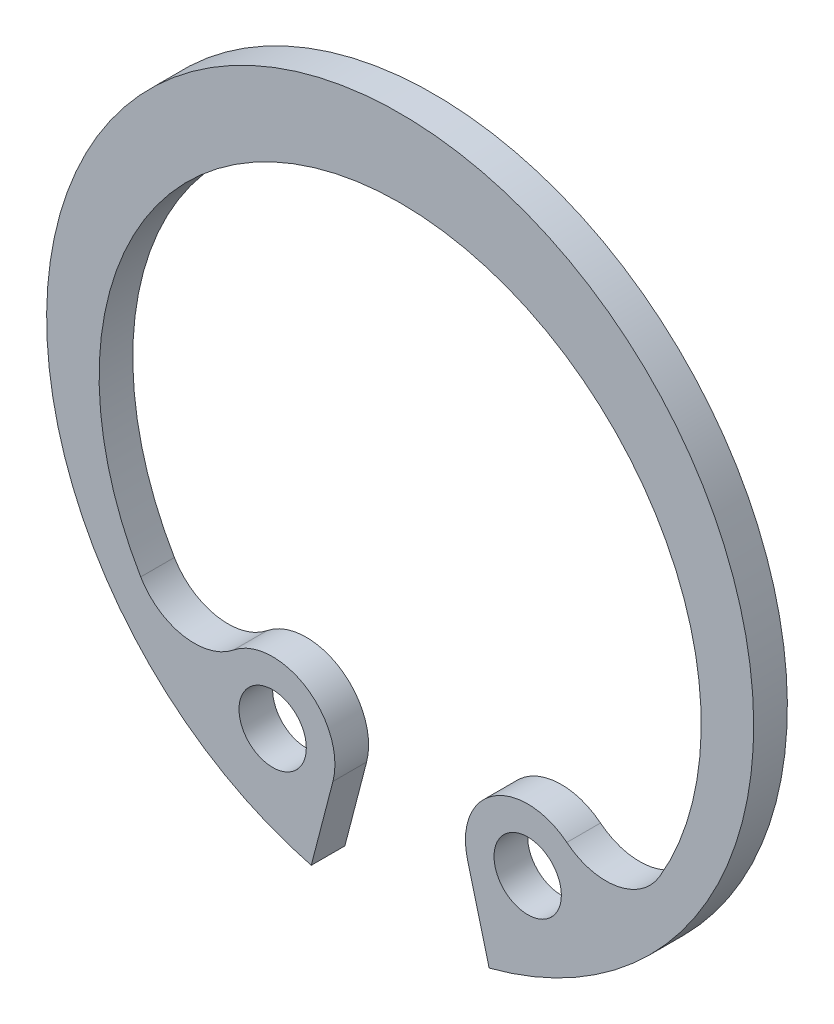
ISO-10303-21;
HEADER;
FILE_DESCRIPTION(('STEP AP214'),'2;1');
FILE_NAME('part.step','',(''),(''),'','','');
FILE_SCHEMA(('AUTOMOTIVE_DESIGN { 1 0 10303 214 1 1 1 1 }'));
ENDSEC;
DATA;
#1=APPLICATION_CONTEXT('core data for automotive mechanical design processes');
#2=APPLICATION_PROTOCOL_DEFINITION('international standard','automotive_design',2000,#1);
#3=PRODUCT_CONTEXT('',#1,'mechanical');
#4=PRODUCT('Part','Part','',(#3));
#5=PRODUCT_RELATED_PRODUCT_CATEGORY('part','',(#4));
#6=PRODUCT_DEFINITION_FORMATION('','',#4);
#7=PRODUCT_DEFINITION_CONTEXT('part definition',#1,'design');
#8=PRODUCT_DEFINITION('design','',#6,#7);
#9=PRODUCT_DEFINITION_SHAPE('','',#8);
#10=(LENGTH_UNIT() NAMED_UNIT(*) SI_UNIT(.MILLI.,.METRE.));
#11=(NAMED_UNIT(*) PLANE_ANGLE_UNIT() SI_UNIT($,.RADIAN.));
#12=(NAMED_UNIT(*) SI_UNIT($,.STERADIAN.) SOLID_ANGLE_UNIT());
#13=UNCERTAINTY_MEASURE_WITH_UNIT(LENGTH_MEASURE(1.E-05),#10,'distance_accuracy_value','');
#14=(GEOMETRIC_REPRESENTATION_CONTEXT(3) GLOBAL_UNCERTAINTY_ASSIGNED_CONTEXT((#13)) GLOBAL_UNIT_ASSIGNED_CONTEXT((#10,
#11,#12)) REPRESENTATION_CONTEXT('',''));
#15=CARTESIAN_POINT('',(0.,0.,0.));
#16=DIRECTION('',(0.,0.,1.));
#17=DIRECTION('',(1.,0.,0.));
#18=AXIS2_PLACEMENT_3D('',#15,#16,#17);
#19=CARTESIAN_POINT('',(0.,0.,-1.));
#20=DIRECTION('',(0.,0.,1.));
#21=DIRECTION('',(1.,0.,0.));
#22=AXIS2_PLACEMENT_3D('',#19,#20,#21);
#23=CYLINDRICAL_SURFACE('',#22,10.5);
#24=CARTESIAN_POINT('',(0.,0.,0.));
#25=DIRECTION('',(0.,0.,1.));
#26=DIRECTION('',(1.,0.,0.));
#27=AXIS2_PLACEMENT_3D('',#24,#25,#26);
#28=CIRCLE('',#27,10.5);
#29=CARTESIAN_POINT('',(2.64166101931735,-10.162264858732,0.));
#30=VERTEX_POINT('',#29);
#31=CARTESIAN_POINT('',(-2.64166101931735,-10.162264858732,0.));
#32=VERTEX_POINT('',#31);
#33=EDGE_CURVE('E130',#30,#32,#28,.T.);
#34=ORIENTED_EDGE('',*,*,#33,.F.);
#35=DIRECTION('',(0.,0.,1.));
#36=VECTOR('',#35,1.);
#37=CARTESIAN_POINT('',(2.64166101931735,-10.162264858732,-1.));
#38=LINE('',#37,#36);
#39=CARTESIAN_POINT('',(2.64166101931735,-10.162264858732,-1.));
#40=VERTEX_POINT('',#39);
#41=EDGE_CURVE('E11',#40,#30,#38,.T.);
#42=ORIENTED_EDGE('',*,*,#41,.F.);
#43=CARTESIAN_POINT('',(0.,0.,-1.));
#44=DIRECTION('',(0.,0.,1.));
#45=DIRECTION('',(1.,0.,0.));
#46=AXIS2_PLACEMENT_3D('',#43,#44,#45);
#47=CIRCLE('',#46,10.5);
#48=CARTESIAN_POINT('',(-2.64166101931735,-10.162264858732,-1.));
#49=VERTEX_POINT('',#48);
#50=EDGE_CURVE('E151',#40,#49,#47,.T.);
#51=ORIENTED_EDGE('',*,*,#50,.T.);
#52=DIRECTION('',(0.,0.,1.));
#53=VECTOR('',#52,1.);
#54=CARTESIAN_POINT('',(-2.64166101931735,-10.162264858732,-1.));
#55=LINE('',#54,#53);
#56=EDGE_CURVE('E36',#49,#32,#55,.T.);
#57=ORIENTED_EDGE('',*,*,#56,.T.);
#58=EDGE_LOOP('',(#34,#42,#51,#57));
#59=FACE_BOUND('',#58,.T.);
#60=ADVANCED_FACE('F33',(#59),#23,.T.);
#61=CARTESIAN_POINT('',(2.64166101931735,-10.162264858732,-1.));
#62=DIRECTION('',(-0.967834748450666,-0.251586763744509,0.));
#63=DIRECTION('',(0.251586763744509,-0.967834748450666,0.));
#64=AXIS2_PLACEMENT_3D('',#61,#62,#63);
#65=PLANE('',#64);
#66=DIRECTION('',(0.251586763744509,-0.967834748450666,0.));
#67=VECTOR('',#66,1.);
#68=CARTESIAN_POINT('',(2.64166101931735,-10.162264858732,0.));
#69=LINE('',#68,#67);
#70=CARTESIAN_POINT('',(1.9969080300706,-7.68195016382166,0.));
#71=VERTEX_POINT('',#70);
#72=EDGE_CURVE('E149',#71,#30,#69,.T.);
#73=ORIENTED_EDGE('',*,*,#72,.F.);
#74=DIRECTION('',(0.,0.,1.));
#75=VECTOR('',#74,1.);
#76=CARTESIAN_POINT('',(1.9969080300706,-7.68195016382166,-1.));
#77=LINE('',#76,#75);
#78=CARTESIAN_POINT('',(1.9969080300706,-7.68195016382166,-1.));
#79=VERTEX_POINT('',#78);
#80=EDGE_CURVE('E42',#79,#71,#77,.T.);
#81=ORIENTED_EDGE('',*,*,#80,.F.);
#82=DIRECTION('',(0.251586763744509,-0.967834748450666,0.));
#83=VECTOR('',#82,1.);
#84=CARTESIAN_POINT('',(2.64166101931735,-10.162264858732,-1.));
#85=LINE('',#84,#83);
#86=EDGE_CURVE('E120',#79,#40,#85,.T.);
#87=ORIENTED_EDGE('',*,*,#86,.T.);
#88=ORIENTED_EDGE('',*,*,#41,.T.);
#89=EDGE_LOOP('',(#73,#81,#87,#88));
#90=FACE_BOUND('',#89,.T.);
#91=ADVANCED_FACE('F163',(#90),#65,.T.);
#92=CARTESIAN_POINT('',(3.78740231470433,-7.21651465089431,-1.));
#93=DIRECTION('',(0.,0.,1.));
#94=DIRECTION('',(1.,0.,0.));
#95=AXIS2_PLACEMENT_3D('',#92,#93,#94);
#96=CYLINDRICAL_SURFACE('',#95,1.85);
#97=CARTESIAN_POINT('',(3.78740231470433,-7.21651465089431,0.));
#98=DIRECTION('',(0.,0.,1.));
#99=DIRECTION('',(1.,0.,0.));
#100=AXIS2_PLACEMENT_3D('',#97,#98,#99);
#101=CIRCLE('',#100,1.85);
#102=CARTESIAN_POINT('',(4.94958425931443,-5.77712827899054,0.));
#103=VERTEX_POINT('',#102);
#104=EDGE_CURVE('E107',#103,#71,#101,.T.);
#105=ORIENTED_EDGE('',*,*,#104,.F.);
#106=DIRECTION('',(0.,0.,1.));
#107=VECTOR('',#106,1.);
#108=CARTESIAN_POINT('',(4.94958425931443,-5.77712827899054,-1.));
#109=LINE('',#108,#107);
#110=CARTESIAN_POINT('',(4.94958425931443,-5.77712827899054,-1.));
#111=VERTEX_POINT('',#110);
#112=EDGE_CURVE('E102',#111,#103,#109,.T.);
#113=ORIENTED_EDGE('',*,*,#112,.F.);
#114=CARTESIAN_POINT('',(3.78740231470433,-7.21651465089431,-1.));
#115=DIRECTION('',(0.,0.,1.));
#116=DIRECTION('',(1.,0.,0.));
#117=AXIS2_PLACEMENT_3D('',#114,#115,#116);
#118=CIRCLE('',#117,1.85);
#119=EDGE_CURVE('E105',#111,#79,#118,.T.);
#120=ORIENTED_EDGE('',*,*,#119,.T.);
#121=ORIENTED_EDGE('',*,*,#80,.T.);
#122=EDGE_LOOP('',(#105,#113,#120,#121));
#123=FACE_BOUND('',#122,.T.);
#124=ADVANCED_FACE('F104',(#123),#96,.T.);
#125=CARTESIAN_POINT('',(6.11176620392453,-4.33774190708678,-1.));
#126=DIRECTION('',(0.,0.,1.));
#127=DIRECTION('',(1.,0.,0.));
#128=AXIS2_PLACEMENT_3D('',#125,#126,#127);
#129=CYLINDRICAL_SURFACE('',#128,1.85);
#130=CARTESIAN_POINT('',(6.11176620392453,-4.33774190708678,0.));
#131=DIRECTION('',(0.,0.,-1.));
#132=DIRECTION('',(1.,0.,0.));
#133=AXIS2_PLACEMENT_3D('',#130,#131,#132);
#134=CIRCLE('',#133,1.85);
#135=CARTESIAN_POINT('',(7.70620618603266,-5.2759642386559,0.));
#136=VERTEX_POINT('',#135);
#137=EDGE_CURVE('E146',#136,#103,#134,.T.);
#138=ORIENTED_EDGE('',*,*,#137,.F.);
#139=DIRECTION('',(0.,0.,1.));
#140=VECTOR('',#139,1.);
#141=CARTESIAN_POINT('',(7.70620618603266,-5.2759642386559,-1.));
#142=LINE('',#141,#140);
#143=CARTESIAN_POINT('',(7.70620618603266,-5.2759642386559,-1.));
#144=VERTEX_POINT('',#143);
#145=EDGE_CURVE('E112',#144,#136,#142,.T.);
#146=ORIENTED_EDGE('',*,*,#145,.F.);
#147=CARTESIAN_POINT('',(6.11176620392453,-4.33774190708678,-1.));
#148=DIRECTION('',(0.,0.,-1.));
#149=DIRECTION('',(1.,0.,0.));
#150=AXIS2_PLACEMENT_3D('',#147,#148,#149);
#151=CIRCLE('',#150,1.85);
#152=EDGE_CURVE('E118',#144,#111,#151,.T.);
#153=ORIENTED_EDGE('',*,*,#152,.T.);
#154=ORIENTED_EDGE('',*,*,#112,.T.);
#155=EDGE_LOOP('',(#138,#146,#153,#154));
#156=FACE_BOUND('',#155,.T.);
#157=ADVANCED_FACE('F122',(#156),#129,.F.);
#158=CARTESIAN_POINT('',(0.,-0.74137227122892,-1.));
#159=DIRECTION('',(0.,0.,1.));
#160=DIRECTION('',(1.,0.,0.));
#161=AXIS2_PLACEMENT_3D('',#158,#159,#160);
#162=CYLINDRICAL_SURFACE('',#161,8.94137227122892);
#163=CARTESIAN_POINT('',(0.,-0.74137227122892,0.));
#164=DIRECTION('',(0.,0.,-1.));
#165=DIRECTION('',(1.,0.,0.));
#166=AXIS2_PLACEMENT_3D('',#163,#164,#165);
#167=CIRCLE('',#166,8.94137227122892);
#168=CARTESIAN_POINT('',(-7.70620618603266,-5.2759642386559,0.));
#169=VERTEX_POINT('',#168);
#170=EDGE_CURVE('E143',#169,#136,#167,.T.);
#171=ORIENTED_EDGE('',*,*,#170,.F.);
#172=DIRECTION('',(0.,0.,1.));
#173=VECTOR('',#172,1.);
#174=CARTESIAN_POINT('',(-7.70620618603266,-5.2759642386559,-1.));
#175=LINE('',#174,#173);
#176=CARTESIAN_POINT('',(-7.70620618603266,-5.2759642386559,-1.));
#177=VERTEX_POINT('',#176);
#178=EDGE_CURVE('E155',#177,#169,#175,.T.);
#179=ORIENTED_EDGE('',*,*,#178,.F.);
#180=CARTESIAN_POINT('',(0.,-0.74137227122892,-1.));
#181=DIRECTION('',(0.,0.,-1.));
#182=DIRECTION('',(1.,0.,0.));
#183=AXIS2_PLACEMENT_3D('',#180,#181,#182);
#184=CIRCLE('',#183,8.94137227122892);
#185=EDGE_CURVE('E123',#177,#144,#184,.T.);
#186=ORIENTED_EDGE('',*,*,#185,.T.);
#187=ORIENTED_EDGE('',*,*,#145,.T.);
#188=EDGE_LOOP('',(#171,#179,#186,#187));
#189=FACE_BOUND('',#188,.T.);
#190=ADVANCED_FACE('F176',(#189),#162,.F.);
#191=CARTESIAN_POINT('',(-6.11176620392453,-4.33774190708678,-1.));
#192=DIRECTION('',(0.,0.,1.));
#193=DIRECTION('',(1.,0.,0.));
#194=AXIS2_PLACEMENT_3D('',#191,#192,#193);
#195=CYLINDRICAL_SURFACE('',#194,1.85);
#196=CARTESIAN_POINT('',(-6.11176620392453,-4.33774190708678,0.));
#197=DIRECTION('',(0.,0.,-1.));
#198=DIRECTION('',(1.,0.,0.));
#199=AXIS2_PLACEMENT_3D('',#196,#197,#198);
#200=CIRCLE('',#199,1.85);
#201=CARTESIAN_POINT('',(-4.94958425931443,-5.77712827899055,0.));
#202=VERTEX_POINT('',#201);
#203=EDGE_CURVE('E140',#202,#169,#200,.T.);
#204=ORIENTED_EDGE('',*,*,#203,.F.);
#205=DIRECTION('',(0.,0.,1.));
#206=VECTOR('',#205,1.);
#207=CARTESIAN_POINT('',(-4.94958425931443,-5.77712827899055,-1.));
#208=LINE('',#207,#206);
#209=CARTESIAN_POINT('',(-4.94958425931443,-5.77712827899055,-1.));
#210=VERTEX_POINT('',#209);
#211=EDGE_CURVE('E157',#210,#202,#208,.T.);
#212=ORIENTED_EDGE('',*,*,#211,.F.);
#213=CARTESIAN_POINT('',(-6.11176620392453,-4.33774190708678,-1.));
#214=DIRECTION('',(0.,0.,-1.));
#215=DIRECTION('',(1.,0.,0.));
#216=AXIS2_PLACEMENT_3D('',#213,#214,#215);
#217=CIRCLE('',#216,1.85);
#218=EDGE_CURVE('E125',#210,#177,#217,.T.);
#219=ORIENTED_EDGE('',*,*,#218,.T.);
#220=ORIENTED_EDGE('',*,*,#178,.T.);
#221=EDGE_LOOP('',(#204,#212,#219,#220));
#222=FACE_BOUND('',#221,.T.);
#223=ADVANCED_FACE('F179',(#222),#195,.F.);
#224=CARTESIAN_POINT('',(-3.78740231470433,-7.21651465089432,-1.));
#225=DIRECTION('',(0.,0.,1.));
#226=DIRECTION('',(1.,0.,0.));
#227=AXIS2_PLACEMENT_3D('',#224,#225,#226);
#228=CYLINDRICAL_SURFACE('',#227,1.85);
#229=CARTESIAN_POINT('',(-3.78740231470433,-7.21651465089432,0.));
#230=DIRECTION('',(0.,0.,1.));
#231=DIRECTION('',(1.,0.,0.));
#232=AXIS2_PLACEMENT_3D('',#229,#230,#231);
#233=CIRCLE('',#232,1.85);
#234=CARTESIAN_POINT('',(-1.9969080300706,-7.68195016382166,0.));
#235=VERTEX_POINT('',#234);
#236=EDGE_CURVE('E137',#235,#202,#233,.T.);
#237=ORIENTED_EDGE('',*,*,#236,.F.);
#238=DIRECTION('',(0.,0.,1.));
#239=VECTOR('',#238,1.);
#240=CARTESIAN_POINT('',(-1.9969080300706,-7.68195016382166,-1.));
#241=LINE('',#240,#239);
#242=CARTESIAN_POINT('',(-1.9969080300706,-7.68195016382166,-1.));
#243=VERTEX_POINT('',#242);
#244=EDGE_CURVE('E158',#243,#235,#241,.T.);
#245=ORIENTED_EDGE('',*,*,#244,.F.);
#246=CARTESIAN_POINT('',(-3.78740231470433,-7.21651465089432,-1.));
#247=DIRECTION('',(0.,0.,1.));
#248=DIRECTION('',(1.,0.,0.));
#249=AXIS2_PLACEMENT_3D('',#246,#247,#248);
#250=CIRCLE('',#249,1.85);
#251=EDGE_CURVE('E225',#243,#210,#250,.T.);
#252=ORIENTED_EDGE('',*,*,#251,.T.);
#253=ORIENTED_EDGE('',*,*,#211,.T.);
#254=EDGE_LOOP('',(#237,#245,#252,#253));
#255=FACE_BOUND('',#254,.T.);
#256=ADVANCED_FACE('F183',(#255),#228,.T.);
#257=CARTESIAN_POINT('',(-2.64166101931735,-10.162264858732,-1.));
#258=DIRECTION('',(0.967834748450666,-0.251586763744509,0.));
#259=DIRECTION('',(0.251586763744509,0.967834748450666,0.));
#260=AXIS2_PLACEMENT_3D('',#257,#258,#259);
#261=PLANE('',#260);
#262=DIRECTION('',(0.251586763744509,0.967834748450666,0.));
#263=VECTOR('',#262,1.);
#264=CARTESIAN_POINT('',(-2.64166101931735,-10.162264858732,0.));
#265=LINE('',#264,#263);
#266=EDGE_CURVE('E133',#32,#235,#265,.T.);
#267=ORIENTED_EDGE('',*,*,#266,.F.);
#268=ORIENTED_EDGE('',*,*,#56,.F.);
#269=DIRECTION('',(0.251586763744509,0.967834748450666,0.));
#270=VECTOR('',#269,1.);
#271=CARTESIAN_POINT('',(-2.64166101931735,-10.162264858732,-1.));
#272=LINE('',#271,#270);
#273=EDGE_CURVE('E223',#49,#243,#272,.T.);
#274=ORIENTED_EDGE('',*,*,#273,.T.);
#275=ORIENTED_EDGE('',*,*,#244,.T.);
#276=EDGE_LOOP('',(#267,#268,#274,#275));
#277=FACE_BOUND('',#276,.T.);
#278=ADVANCED_FACE('F160',(#277),#261,.T.);
#279=CARTESIAN_POINT('',(0.,0.,-1.));
#280=DIRECTION('',(0.,0.,1.));
#281=DIRECTION('',(1.,0.,0.));
#282=AXIS2_PLACEMENT_3D('',#279,#280,#281);
#283=PLANE('',#282);
#284=CARTESIAN_POINT('',(-3.78740231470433,-7.21651465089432,-1.));
#285=DIRECTION('',(0.,0.,1.));
#286=DIRECTION('',(1.,0.,0.));
#287=AXIS2_PLACEMENT_3D('',#284,#285,#286);
#288=CIRCLE('',#287,1.);
#289=CARTESIAN_POINT('',(-2.78740231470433,-7.21651465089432,-1.));
#290=VERTEX_POINT('',#289);
#291=EDGE_CURVE('E210',#290,#290,#288,.T.);
#292=ORIENTED_EDGE('',*,*,#291,.T.);
#293=EDGE_LOOP('',(#292));
#294=FACE_BOUND('',#293,.T.);
#295=CARTESIAN_POINT('',(3.78740231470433,-7.21651465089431,-1.));
#296=DIRECTION('',(0.,0.,1.));
#297=DIRECTION('',(1.,0.,0.));
#298=AXIS2_PLACEMENT_3D('',#295,#296,#297);
#299=CIRCLE('',#298,1.);
#300=CARTESIAN_POINT('',(4.78740231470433,-7.21651465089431,-1.));
#301=VERTEX_POINT('',#300);
#302=EDGE_CURVE('E134',#301,#301,#299,.T.);
#303=ORIENTED_EDGE('',*,*,#302,.T.);
#304=EDGE_LOOP('',(#303));
#305=FACE_BOUND('',#304,.T.);
#306=ORIENTED_EDGE('',*,*,#50,.F.);
#307=ORIENTED_EDGE('',*,*,#86,.F.);
#308=ORIENTED_EDGE('',*,*,#119,.F.);
#309=ORIENTED_EDGE('',*,*,#152,.F.);
#310=ORIENTED_EDGE('',*,*,#185,.F.);
#311=ORIENTED_EDGE('',*,*,#218,.F.);
#312=ORIENTED_EDGE('',*,*,#251,.F.);
#313=ORIENTED_EDGE('',*,*,#273,.F.);
#314=EDGE_LOOP('',(#306,#307,#308,#309,#310,#311,#312,#313));
#315=FACE_BOUND('',#314,.T.);
#316=ADVANCED_FACE('F116',(#294,#305,#315),#283,.F.);
#317=CARTESIAN_POINT('',(0.,0.,0.));
#318=DIRECTION('',(0.,0.,1.));
#319=DIRECTION('',(1.,0.,0.));
#320=AXIS2_PLACEMENT_3D('',#317,#318,#319);
#321=PLANE('',#320);
#322=CARTESIAN_POINT('',(-3.78740231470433,-7.21651465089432,0.));
#323=DIRECTION('',(0.,0.,1.));
#324=DIRECTION('',(1.,0.,0.));
#325=AXIS2_PLACEMENT_3D('',#322,#323,#324);
#326=CIRCLE('',#325,1.);
#327=CARTESIAN_POINT('',(-2.78740231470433,-7.21651465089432,0.));
#328=VERTEX_POINT('',#327);
#329=EDGE_CURVE('E213',#328,#328,#326,.T.);
#330=ORIENTED_EDGE('',*,*,#329,.F.);
#331=EDGE_LOOP('',(#330));
#332=FACE_BOUND('',#331,.T.);
#333=CARTESIAN_POINT('',(3.78740231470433,-7.21651465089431,0.));
#334=DIRECTION('',(0.,0.,1.));
#335=DIRECTION('',(1.,0.,0.));
#336=AXIS2_PLACEMENT_3D('',#333,#334,#335);
#337=CIRCLE('',#336,1.);
#338=CARTESIAN_POINT('',(4.78740231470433,-7.21651465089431,0.));
#339=VERTEX_POINT('',#338);
#340=EDGE_CURVE('E215',#339,#339,#337,.T.);
#341=ORIENTED_EDGE('',*,*,#340,.F.);
#342=EDGE_LOOP('',(#341));
#343=FACE_BOUND('',#342,.T.);
#344=ORIENTED_EDGE('',*,*,#33,.T.);
#345=ORIENTED_EDGE('',*,*,#266,.T.);
#346=ORIENTED_EDGE('',*,*,#236,.T.);
#347=ORIENTED_EDGE('',*,*,#203,.T.);
#348=ORIENTED_EDGE('',*,*,#170,.T.);
#349=ORIENTED_EDGE('',*,*,#137,.T.);
#350=ORIENTED_EDGE('',*,*,#104,.T.);
#351=ORIENTED_EDGE('',*,*,#72,.T.);
#352=EDGE_LOOP('',(#344,#345,#346,#347,#348,#349,#350,#351));
#353=FACE_BOUND('',#352,.T.);
#354=ADVANCED_FACE('F162',(#332,#343,#353),#321,.T.);
#355=CARTESIAN_POINT('',(3.78740231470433,-7.21651465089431,-1.));
#356=DIRECTION('',(0.,0.,1.));
#357=DIRECTION('',(1.,0.,0.));
#358=AXIS2_PLACEMENT_3D('',#355,#356,#357);
#359=CYLINDRICAL_SURFACE('',#358,1.);
#360=ORIENTED_EDGE('',*,*,#302,.F.);
#361=EDGE_LOOP('',(#360));
#362=FACE_BOUND('',#361,.T.);
#363=ORIENTED_EDGE('',*,*,#340,.T.);
#364=EDGE_LOOP('',(#363));
#365=FACE_BOUND('',#364,.T.);
#366=ADVANCED_FACE('F195',(#362,#365),#359,.F.);
#367=CARTESIAN_POINT('',(-3.78740231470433,-7.21651465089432,-1.));
#368=DIRECTION('',(0.,0.,1.));
#369=DIRECTION('',(1.,0.,0.));
#370=AXIS2_PLACEMENT_3D('',#367,#368,#369);
#371=CYLINDRICAL_SURFACE('',#370,1.);
#372=ORIENTED_EDGE('',*,*,#291,.F.);
#373=EDGE_LOOP('',(#372));
#374=FACE_BOUND('',#373,.T.);
#375=ORIENTED_EDGE('',*,*,#329,.T.);
#376=EDGE_LOOP('',(#375));
#377=FACE_BOUND('',#376,.T.);
#378=ADVANCED_FACE('F202',(#374,#377),#371,.F.);
#379=CLOSED_SHELL('',(#60,#91,#124,#157,#190,#223,#256,#278,#316,#354,#366,#378));
#380=MANIFOLD_SOLID_BREP('B2',#379);
#381=ADVANCED_BREP_SHAPE_REPRESENTATION('',(#18,#380),#14);
#382=SHAPE_DEFINITION_REPRESENTATION(#9,#381);
ENDSEC;
END-ISO-10303-21;
